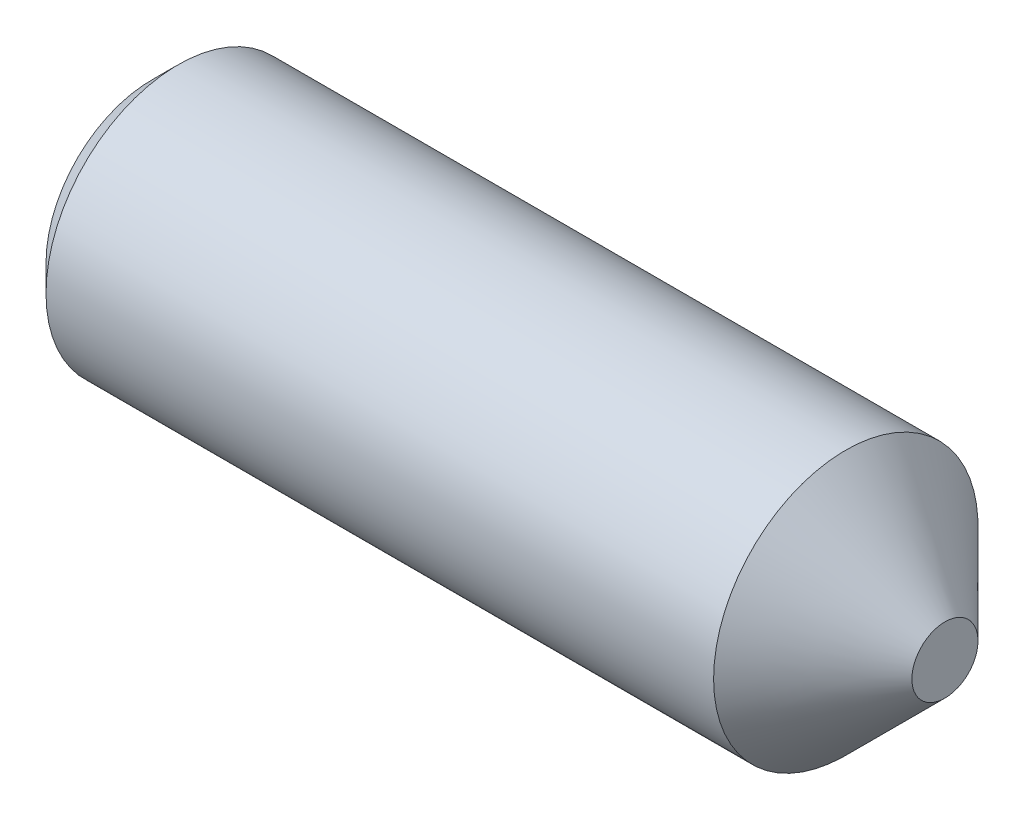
from build123d import *

# Parameters (mm, degrees)
ENL_V_MAT_EXTRU_1_DEPTH = 5


with BuildPart() as part:
    # Esquisse2 → Base-R_volution (revolve)
    with BuildSketch(Plane.XY, mode=Mode.PRIVATE) as base_r_volution_sk:
        Polygon((-20.25, 5), (5, 5), (8.75, 1.25), (8.75, 0), (-21.25, 0), (-21.25, 4), align=None)
    revolve(base_r_volution_sk.sketch.rotate(Axis((-21.25, 0, 0), (1, 0, 0)), 90), axis=Axis((-21.25, 0, 0), (1, 0, 0)))

    # Esquisse3 → Enl_v. mat.-Extru.1 (cut)
    with BuildSketch(Plane.ZY.offset(21.25)):
        Polygon((2.886751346, 0), (1.443375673, 2.5), (-1.443375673, 2.5), (-2.886751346, 0), (-1.443375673, -2.5), (1.443375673, -2.5), align=None)
    extrude(amount=-ENL_V_MAT_EXTRU_1_DEPTH, mode=Mode.SUBTRACT)


solid = part.part
